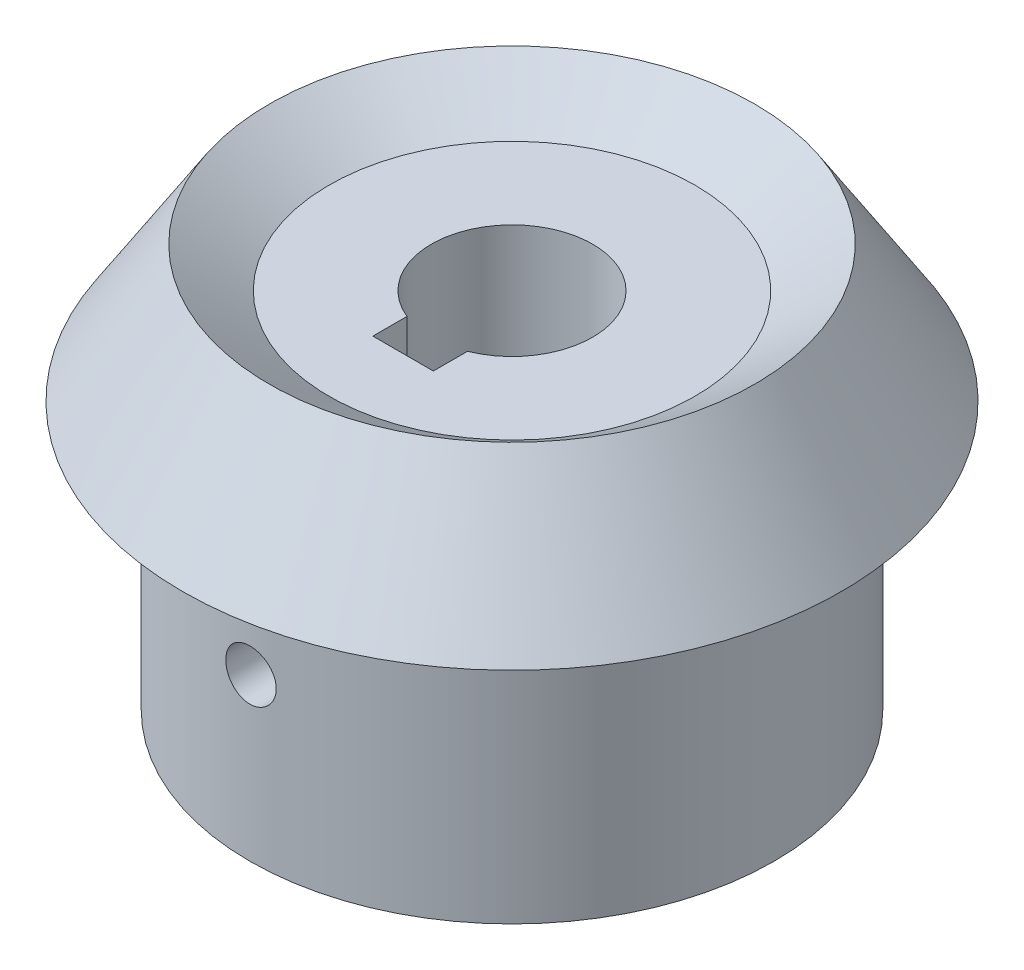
ISO-10303-21;
HEADER;
FILE_DESCRIPTION(('STEP AP214'),'2;1');
FILE_NAME('part.step','',(''),(''),'','','');
FILE_SCHEMA(('AUTOMOTIVE_DESIGN { 1 0 10303 214 1 1 1 1 }'));
ENDSEC;
DATA;
#1=APPLICATION_CONTEXT('core data for automotive mechanical design processes');
#2=APPLICATION_PROTOCOL_DEFINITION('international standard','automotive_design',2000,#1);
#3=PRODUCT_CONTEXT('',#1,'mechanical');
#4=PRODUCT('Part','Part','',(#3));
#5=PRODUCT_RELATED_PRODUCT_CATEGORY('part','',(#4));
#6=PRODUCT_DEFINITION_FORMATION('','',#4);
#7=PRODUCT_DEFINITION_CONTEXT('part definition',#1,'design');
#8=PRODUCT_DEFINITION('design','',#6,#7);
#9=PRODUCT_DEFINITION_SHAPE('','',#8);
#10=(LENGTH_UNIT() NAMED_UNIT(*) SI_UNIT(.MILLI.,.METRE.));
#11=(NAMED_UNIT(*) PLANE_ANGLE_UNIT() SI_UNIT($,.RADIAN.));
#12=(NAMED_UNIT(*) SI_UNIT($,.STERADIAN.) SOLID_ANGLE_UNIT());
#13=UNCERTAINTY_MEASURE_WITH_UNIT(LENGTH_MEASURE(1.E-05),#10,'distance_accuracy_value','');
#14=(GEOMETRIC_REPRESENTATION_CONTEXT(3) GLOBAL_UNCERTAINTY_ASSIGNED_CONTEXT((#13)) GLOBAL_UNIT_ASSIGNED_CONTEXT((#10,
#11,#12)) REPRESENTATION_CONTEXT('',''));
#15=CARTESIAN_POINT('',(0.,0.,0.));
#16=DIRECTION('',(0.,0.,1.));
#17=DIRECTION('',(1.,0.,0.));
#18=AXIS2_PLACEMENT_3D('',#15,#16,#17);
#19=CARTESIAN_POINT('',(0.,0.,0.));
#20=DIRECTION('',(0.,-1.,0.));
#21=DIRECTION('',(0.,0.,-1.));
#22=AXIS2_PLACEMENT_3D('',#19,#20,#21);
#23=CYLINDRICAL_SURFACE('',#22,4.);
#24=DIRECTION('',(0.,-1.,0.));
#25=VECTOR('',#24,1.);
#26=CARTESIAN_POINT('',(1.49999999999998,-6.93889390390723E-13,3.70809924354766));
#27=LINE('',#26,#25);
#28=CARTESIAN_POINT('',(1.49999999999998,18.,3.70809924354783));
#29=VERTEX_POINT('',#28);
#30=CARTESIAN_POINT('',(1.49999999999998,-6.93889390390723E-13,3.70809924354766));
#31=VERTEX_POINT('',#30);
#32=EDGE_CURVE('E71',#29,#31,#27,.T.);
#33=ORIENTED_EDGE('',*,*,#32,.F.);
#34=CARTESIAN_POINT('',(0.,18.,0.));
#35=DIRECTION('',(0.,-1.,0.));
#36=DIRECTION('',(0.,0.,-1.));
#37=AXIS2_PLACEMENT_3D('',#34,#35,#36);
#38=CIRCLE('',#37,4.);
#39=CARTESIAN_POINT('',(-1.50000000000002,18.,3.70809924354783));
#40=VERTEX_POINT('',#39);
#41=EDGE_CURVE('E95',#40,#29,#38,.T.);
#42=ORIENTED_EDGE('',*,*,#41,.F.);
#43=DIRECTION('',(0.,-1.,0.));
#44=VECTOR('',#43,1.);
#45=CARTESIAN_POINT('',(-1.50000000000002,-5.55111512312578E-13,3.70809924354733));
#46=LINE('',#45,#44);
#47=CARTESIAN_POINT('',(-1.50000000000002,-5.55111512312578E-13,3.70809924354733));
#48=VERTEX_POINT('',#47);
#49=EDGE_CURVE('E91',#48,#40,#46,.F.);
#50=ORIENTED_EDGE('',*,*,#49,.F.);
#51=CARTESIAN_POINT('',(0.,0.,0.));
#52=DIRECTION('',(0.,-1.,0.));
#53=DIRECTION('',(0.,0.,-1.));
#54=AXIS2_PLACEMENT_3D('',#51,#52,#53);
#55=CIRCLE('',#54,4.);
#56=EDGE_CURVE('E113',#48,#31,#55,.T.);
#57=ORIENTED_EDGE('',*,*,#56,.T.);
#58=EDGE_LOOP('',(#33,#42,#50,#57));
#59=FACE_BOUND('',#58,.T.);
#60=ADVANCED_FACE('F30',(#59),#23,.F.);
#61=CARTESIAN_POINT('',(4.,0.,0.));
#62=DIRECTION('',(0.,-1.,0.));
#63=DIRECTION('',(0.,0.,-1.));
#64=AXIS2_PLACEMENT_3D('',#61,#62,#63);
#65=PLANE('',#64);
#66=DIRECTION('',(0.,0.,1.));
#67=VECTOR('',#66,1.);
#68=CARTESIAN_POINT('',(1.49999999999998,-2.13717932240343E-12,-0.440807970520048));
#69=LINE('',#68,#67);
#70=CARTESIAN_POINT('',(1.49999999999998,0.,5.4));
#71=VERTEX_POINT('',#70);
#72=EDGE_CURVE('E67',#31,#71,#69,.T.);
#73=ORIENTED_EDGE('',*,*,#72,.F.);
#74=ORIENTED_EDGE('',*,*,#56,.F.);
#75=DIRECTION('',(0.,0.,-1.));
#76=VECTOR('',#75,1.);
#77=CARTESIAN_POINT('',(-1.50000000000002,-2.13717932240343E-12,-0.44080797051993));
#78=LINE('',#77,#76);
#79=CARTESIAN_POINT('',(-1.50000000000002,0.,5.4));
#80=VERTEX_POINT('',#79);
#81=EDGE_CURVE('E83',#80,#48,#78,.T.);
#82=ORIENTED_EDGE('',*,*,#81,.F.);
#83=DIRECTION('',(-1.,0.,0.));
#84=VECTOR('',#83,1.);
#85=CARTESIAN_POINT('',(1.49999999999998,0.,5.4));
#86=LINE('',#85,#84);
#87=EDGE_CURVE('E76',#71,#80,#86,.T.);
#88=ORIENTED_EDGE('',*,*,#87,.F.);
#89=EDGE_LOOP('',(#73,#74,#82,#88));
#90=FACE_BOUND('',#89,.T.);
#91=CARTESIAN_POINT('',(0.,0.,0.));
#92=DIRECTION('',(0.,-1.,0.));
#93=DIRECTION('',(0.,0.,-1.));
#94=AXIS2_PLACEMENT_3D('',#91,#92,#93);
#95=CIRCLE('',#94,13.);
#96=CARTESIAN_POINT('',(0.,0.,-13.));
#97=VERTEX_POINT('',#96);
#98=EDGE_CURVE('E110',#97,#97,#95,.T.);
#99=ORIENTED_EDGE('',*,*,#98,.T.);
#100=EDGE_LOOP('',(#99));
#101=FACE_BOUND('',#100,.T.);
#102=ADVANCED_FACE('F85',(#90,#101),#65,.T.);
#103=CARTESIAN_POINT('',(0.,0.,0.));
#104=DIRECTION('',(0.,-1.,0.));
#105=DIRECTION('',(0.,0.,-1.));
#106=AXIS2_PLACEMENT_3D('',#103,#104,#105);
#107=CYLINDRICAL_SURFACE('',#106,13.);
#108=CARTESIAN_POINT('',(-1.25000000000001,8.00000000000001,12.9397642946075));
#109=CARTESIAN_POINT('',(-1.24999695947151,7.92996129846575,12.9397650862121));
#110=CARTESIAN_POINT('',(-1.24409367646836,7.85987594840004,12.9403390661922));
#111=CARTESIAN_POINT('',(-1.22063294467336,7.72164740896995,12.942572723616));
#112=CARTESIAN_POINT('',(-1.20306256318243,7.65350646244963,12.9442336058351));
#113=CARTESIAN_POINT('',(-1.15678313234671,7.52118856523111,12.9484512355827));
#114=CARTESIAN_POINT('',(-1.12808072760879,7.45700927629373,12.9510074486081));
#115=CARTESIAN_POINT('',(-1.06036454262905,7.33439347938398,12.9567270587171));
#116=CARTESIAN_POINT('',(-1.02135284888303,7.27595581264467,12.9598903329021));
#117=CARTESIAN_POINT('',(-0.933983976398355,7.16627079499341,12.9664795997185));
#118=CARTESIAN_POINT('',(-0.885599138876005,7.11504551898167,12.9699063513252));
#119=CARTESIAN_POINT('',(-0.780916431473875,7.02142936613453,12.976629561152));
#120=CARTESIAN_POINT('',(-0.72461820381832,6.97903888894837,12.9799260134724));
#121=CARTESIAN_POINT('',(-0.605572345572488,6.90421995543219,12.9860246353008));
#122=CARTESIAN_POINT('',(-0.542812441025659,6.871810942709,12.9888258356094));
#123=CARTESIAN_POINT('',(-0.412710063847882,6.81799929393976,12.9936100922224));
#124=CARTESIAN_POINT('',(-0.345367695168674,6.79659640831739,12.9955931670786));
#125=CARTESIAN_POINT('',(-0.208234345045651,6.76546905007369,12.9985124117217));
#126=CARTESIAN_POINT('',(-0.138451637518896,6.75570843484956,12.9994518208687));
#127=CARTESIAN_POINT('',(0.0017673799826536,6.74803087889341,13.0001888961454));
#128=CARTESIAN_POINT('',(0.0722036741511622,6.75011365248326,12.9999865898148));
#129=CARTESIAN_POINT('',(0.211485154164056,6.76603435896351,12.9984656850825));
#130=CARTESIAN_POINT('',(0.280334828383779,6.77983342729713,12.9971507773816));
#131=CARTESIAN_POINT('',(0.414736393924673,6.81873450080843,12.9935567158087));
#132=CARTESIAN_POINT('',(0.480288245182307,6.84383664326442,12.9912775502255));
#133=CARTESIAN_POINT('',(0.60635618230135,6.90467409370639,12.9860049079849));
#134=CARTESIAN_POINT('',(0.666863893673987,6.94042665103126,12.9830102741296));
#135=CARTESIAN_POINT('',(0.781034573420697,7.02153752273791,12.9766428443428));
#136=CARTESIAN_POINT('',(0.834697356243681,7.06689609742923,12.9732700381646));
#137=CARTESIAN_POINT('',(0.933882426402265,7.16615013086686,12.966508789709));
#138=CARTESIAN_POINT('',(0.979370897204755,7.2200793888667,12.9631203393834));
#139=CARTESIAN_POINT('',(1.06065442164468,7.3348266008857,12.9567233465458));
#140=CARTESIAN_POINT('',(1.0964494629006,7.39564456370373,12.9537148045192));
#141=CARTESIAN_POINT('',(1.1573295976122,7.52246822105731,12.9484179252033));
#142=CARTESIAN_POINT('',(1.18241268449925,7.58847488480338,12.9461297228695));
#143=CARTESIAN_POINT('',(1.22113055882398,7.72378979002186,12.9425353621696));
#144=CARTESIAN_POINT('',(1.2347656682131,7.79309793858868,12.9412291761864));
#145=CARTESIAN_POINT('',(1.2501572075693,7.93275177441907,12.9397514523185));
#146=CARTESIAN_POINT('',(1.25196090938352,8.00309220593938,12.9395753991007));
#147=CARTESIAN_POINT('',(1.24376250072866,8.14307434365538,12.9403659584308));
#148=CARTESIAN_POINT('',(1.23376053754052,8.21271605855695,12.9413325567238));
#149=CARTESIAN_POINT('',(1.2022742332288,8.34918661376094,12.9442953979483));
#150=CARTESIAN_POINT('',(1.18081217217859,8.41602064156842,12.9462896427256));
#151=CARTESIAN_POINT('',(1.12703762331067,8.54513976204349,12.9510814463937));
#152=CARTESIAN_POINT('',(1.09472490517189,8.60742475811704,12.9538790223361));
#153=CARTESIAN_POINT('',(1.02004756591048,8.72589345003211,12.9599732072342));
#154=CARTESIAN_POINT('',(0.977651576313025,8.78205729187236,12.9632713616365));
#155=CARTESIAN_POINT('',(0.884056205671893,8.88648822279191,12.9699899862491));
#156=CARTESIAN_POINT('',(0.832856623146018,8.93475513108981,12.9734104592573));
#157=CARTESIAN_POINT('',(0.72290255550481,9.0221846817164,12.980001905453));
#158=CARTESIAN_POINT('',(0.664123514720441,9.06131651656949,12.9831720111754));
#159=CARTESIAN_POINT('',(0.540800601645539,9.12915326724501,12.9888929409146));
#160=CARTESIAN_POINT('',(0.47625680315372,9.15785831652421,12.9914437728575));
#161=CARTESIAN_POINT('',(0.343344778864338,9.20397428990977,12.9956348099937));
#162=CARTESIAN_POINT('',(0.27498309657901,9.22140393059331,12.997276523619));
#163=CARTESIAN_POINT('',(0.136286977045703,9.24453542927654,12.9994705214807));
#164=CARTESIAN_POINT('',(0.0659525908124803,9.25023759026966,13.0000228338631));
#165=CARTESIAN_POINT('',(-0.0743895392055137,9.24974818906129,12.9999757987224));
#166=CARTESIAN_POINT('',(-0.144397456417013,9.24360449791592,12.9993810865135));
#167=CARTESIAN_POINT('',(-0.282381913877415,9.2196980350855,12.9971159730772));
#168=CARTESIAN_POINT('',(-0.350358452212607,9.20193525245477,12.9954455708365));
#169=CARTESIAN_POINT('',(-0.482351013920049,9.15530782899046,12.9912162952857));
#170=CARTESIAN_POINT('',(-0.546367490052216,9.12644446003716,12.9886575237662));
#171=CARTESIAN_POINT('',(-0.668654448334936,9.05844036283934,12.9829369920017));
#172=CARTESIAN_POINT('',(-0.726924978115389,9.01929971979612,12.9797752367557));
#173=CARTESIAN_POINT('',(-0.83631125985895,8.93167248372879,12.9731878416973));
#174=CARTESIAN_POINT('',(-0.887398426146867,8.88315027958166,12.9697612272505));
#175=CARTESIAN_POINT('',(-0.980727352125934,8.77820641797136,12.9630385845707));
#176=CARTESIAN_POINT('',(-1.02296698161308,8.7217828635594,12.9597425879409));
#177=CARTESIAN_POINT('',(-1.09747961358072,8.60249289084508,12.9536459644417));
#178=CARTESIAN_POINT('',(-1.12972870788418,8.53961148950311,12.9508465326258));
#179=CARTESIAN_POINT('',(-1.18316795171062,8.40934006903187,12.9460743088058));
#180=CARTESIAN_POINT('',(-1.20437063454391,8.34195525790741,12.9441005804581));
#181=CARTESIAN_POINT('',(-1.22979995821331,8.22848738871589,12.9417034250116));
#182=CARTESIAN_POINT('',(-1.23736469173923,8.18313087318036,12.9409796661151));
#183=CARTESIAN_POINT('',(-1.24746570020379,8.09185625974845,12.9400098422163));
#184=CARTESIAN_POINT('',(-1.2500019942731,8.04593816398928,12.9397637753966));
#185=CARTESIAN_POINT('',(-1.25000000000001,8.00000000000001,12.9397642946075));
#186=B_SPLINE_CURVE_WITH_KNOTS('',3,(#108,#109,#110,#111,#112,#113,#114,#115,#116,#117,#118,
#119,#120,#121,#122,#123,#124,#125,#126,#127,#128,#129,#130,#131,#132,#133,#134,#135,#136,#137,
#138,#139,#140,#141,#142,#143,#144,#145,#146,#147,#148,#149,#150,#151,#152,#153,#154,#155,#156,
#157,#158,#159,#160,#161,#162,#163,#164,#165,#166,#167,#168,#169,#170,#171,#172,#173,#174,#175,
#176,#177,#178,#179,#180,#181,#182,#183,#184,#185),.UNSPECIFIED.,.T.,.F.,(4,2,2,2,2,2,2,2,2,2,2,
2,2,2,2,2,2,2,2,2,2,2,2,2,2,2,2,2,2,2,2,2,2,2,2,2,2,2,4),(0.,0.209948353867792,
0.420129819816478,0.630186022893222,0.840199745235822,1.05084289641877,1.26149557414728,
1.47255603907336,1.68361171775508,1.8940104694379,2.10440414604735,2.31410263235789,
2.52380366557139,2.73384619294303,2.94389441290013,3.15479252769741,3.36569091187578,
3.57662878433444,3.78756072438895,3.99764937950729,4.20773541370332,4.41741448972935,
4.62709801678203,4.83744259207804,5.0477919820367,5.25884083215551,5.46988698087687,
5.6805818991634,5.89127137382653,6.10111120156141,6.31095122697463,6.52076721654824,
6.73058146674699,6.94120835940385,7.15188590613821,7.36306379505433,7.57400155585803,
7.71170654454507,7.84941100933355),.UNSPECIFIED.);
#187=CARTESIAN_POINT('',(-1.25000000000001,8.00000000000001,12.9397642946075));
#188=VERTEX_POINT('',#187);
#189=EDGE_CURVE('E161',#188,#188,#186,.T.);
#190=ORIENTED_EDGE('',*,*,#189,.F.);
#191=EDGE_LOOP('',(#190));
#192=FACE_BOUND('',#191,.T.);
#193=CARTESIAN_POINT('',(0.,10.9999999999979,-1.11022302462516E-13));
#194=DIRECTION('',(0.,-1.,0.));
#195=DIRECTION('',(0.,0.,-1.));
#196=AXIS2_PLACEMENT_3D('',#193,#194,#195);
#197=CIRCLE('',#196,13.);
#198=CARTESIAN_POINT('',(0.,10.9999999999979,-13.0000000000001));
#199=VERTEX_POINT('',#198);
#200=EDGE_CURVE('E107',#199,#199,#197,.T.);
#201=ORIENTED_EDGE('',*,*,#200,.T.);
#202=EDGE_LOOP('',(#201));
#203=FACE_BOUND('',#202,.T.);
#204=ORIENTED_EDGE('',*,*,#98,.F.);
#205=EDGE_LOOP('',(#204));
#206=FACE_BOUND('',#205,.T.);
#207=ADVANCED_FACE('F128',(#192,#203,#206),#107,.T.);
#208=CARTESIAN_POINT('',(0.,10.9999999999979,-1.11022302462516E-13));
#209=DIRECTION('',(0.,1.,0.));
#210=DIRECTION('',(0.,0.,1.));
#211=AXIS2_PLACEMENT_3D('',#208,#209,#210);
#212=CONICAL_SURFACE('',#211,13.,0.977046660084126);
#213=CARTESIAN_POINT('',(0.,13.2545,0.));
#214=DIRECTION('',(0.,-1.,0.));
#215=DIRECTION('',(0.,0.,-1.));
#216=AXIS2_PLACEMENT_3D('',#213,#214,#215);
#217=CIRCLE('',#216,16.34);
#218=CARTESIAN_POINT('',(0.,13.2545,-16.34));
#219=VERTEX_POINT('',#218);
#220=EDGE_CURVE('E104',#219,#219,#217,.T.);
#221=ORIENTED_EDGE('',*,*,#220,.T.);
#222=EDGE_LOOP('',(#221));
#223=FACE_BOUND('',#222,.T.);
#224=ORIENTED_EDGE('',*,*,#200,.F.);
#225=EDGE_LOOP('',(#224));
#226=FACE_BOUND('',#225,.T.);
#227=ADVANCED_FACE('F132',(#223,#226),#212,.T.);
#228=CARTESIAN_POINT('',(0.,13.2545,0.));
#229=DIRECTION('',(0.,-1.,0.));
#230=DIRECTION('',(0.,0.,-1.));
#231=AXIS2_PLACEMENT_3D('',#228,#229,#230);
#232=CONICAL_SURFACE('',#231,16.34,0.568126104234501);
#233=CARTESIAN_POINT('',(0.,20.,0.));
#234=DIRECTION('',(0.,-1.,0.));
#235=DIRECTION('',(0.,0.,-1.));
#236=AXIS2_PLACEMENT_3D('',#233,#234,#235);
#237=CIRCLE('',#236,12.0341588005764);
#238=CARTESIAN_POINT('',(0.,20.,-12.0341588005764));
#239=VERTEX_POINT('',#238);
#240=EDGE_CURVE('E101',#239,#239,#237,.T.);
#241=ORIENTED_EDGE('',*,*,#240,.T.);
#242=EDGE_LOOP('',(#241));
#243=FACE_BOUND('',#242,.T.);
#244=ORIENTED_EDGE('',*,*,#220,.F.);
#245=EDGE_LOOP('',(#244));
#246=FACE_BOUND('',#245,.T.);
#247=ADVANCED_FACE('F138',(#243,#246),#232,.T.);
#248=CARTESIAN_POINT('',(0.,20.,0.));
#249=DIRECTION('',(0.,1.,0.));
#250=DIRECTION('',(0.,0.,1.));
#251=AXIS2_PLACEMENT_3D('',#248,#249,#250);
#252=CONICAL_SURFACE('',#251,12.0341588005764,0.977046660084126);
#253=CARTESIAN_POINT('',(0.,18.,0.));
#254=DIRECTION('',(0.,-1.,0.));
#255=DIRECTION('',(0.,0.,-1.));
#256=AXIS2_PLACEMENT_3D('',#253,#254,#255);
#257=CIRCLE('',#256,9.07119583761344);
#258=CARTESIAN_POINT('',(0.,18.,-9.07119583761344));
#259=VERTEX_POINT('',#258);
#260=EDGE_CURVE('E98',#259,#259,#257,.T.);
#261=ORIENTED_EDGE('',*,*,#260,.T.);
#262=EDGE_LOOP('',(#261));
#263=FACE_BOUND('',#262,.T.);
#264=ORIENTED_EDGE('',*,*,#240,.F.);
#265=EDGE_LOOP('',(#264));
#266=FACE_BOUND('',#265,.T.);
#267=ADVANCED_FACE('F142',(#263,#266),#252,.F.);
#268=CARTESIAN_POINT('',(9.07119583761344,18.,5.34294830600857E-13));
#269=DIRECTION('',(0.,1.,0.));
#270=DIRECTION('',(0.,0.,1.));
#271=AXIS2_PLACEMENT_3D('',#268,#269,#270);
#272=PLANE('',#271);
#273=DIRECTION('',(0.,0.,-1.));
#274=VECTOR('',#273,1.);
#275=CARTESIAN_POINT('',(1.49999999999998,18.,0.));
#276=LINE('',#275,#274);
#277=CARTESIAN_POINT('',(1.49999999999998,17.9999999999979,5.39999999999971));
#278=VERTEX_POINT('',#277);
#279=EDGE_CURVE('E11',#278,#29,#276,.T.);
#280=ORIENTED_EDGE('',*,*,#279,.F.);
#281=DIRECTION('',(1.,0.,0.));
#282=VECTOR('',#281,1.);
#283=CARTESIAN_POINT('',(9.07119583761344,17.9999999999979,5.39999999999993));
#284=LINE('',#283,#282);
#285=CARTESIAN_POINT('',(-1.50000000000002,17.9999999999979,5.39999999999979));
#286=VERTEX_POINT('',#285);
#287=EDGE_CURVE('E82',#286,#278,#284,.T.);
#288=ORIENTED_EDGE('',*,*,#287,.F.);
#289=DIRECTION('',(0.,0.,1.));
#290=VECTOR('',#289,1.);
#291=CARTESIAN_POINT('',(-1.50000000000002,18.,0.));
#292=LINE('',#291,#290);
#293=EDGE_CURVE('E37',#40,#286,#292,.T.);
#294=ORIENTED_EDGE('',*,*,#293,.F.);
#295=ORIENTED_EDGE('',*,*,#41,.T.);
#296=EDGE_LOOP('',(#280,#288,#294,#295));
#297=FACE_BOUND('',#296,.T.);
#298=ORIENTED_EDGE('',*,*,#260,.F.);
#299=EDGE_LOOP('',(#298));
#300=FACE_BOUND('',#299,.T.);
#301=ADVANCED_FACE('F121',(#297,#300),#272,.T.);
#302=CARTESIAN_POINT('',(1.49999999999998,19.9999999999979,-0.440807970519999));
#303=DIRECTION('',(1.,0.,0.));
#304=DIRECTION('',(0.,0.,-1.));
#305=AXIS2_PLACEMENT_3D('',#302,#303,#304);
#306=PLANE('',#305);
#307=ORIENTED_EDGE('',*,*,#32,.T.);
#308=ORIENTED_EDGE('',*,*,#72,.T.);
#309=DIRECTION('',(0.,-1.,0.));
#310=VECTOR('',#309,1.);
#311=CARTESIAN_POINT('',(1.49999999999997,20.,5.4));
#312=LINE('',#311,#310);
#313=EDGE_CURVE('E70',#278,#71,#312,.T.);
#314=ORIENTED_EDGE('',*,*,#313,.F.);
#315=ORIENTED_EDGE('',*,*,#279,.T.);
#316=EDGE_LOOP('',(#307,#308,#314,#315));
#317=FACE_BOUND('',#316,.T.);
#318=ADVANCED_FACE('F69',(#317),#306,.F.);
#319=CARTESIAN_POINT('',(-1.50000000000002,19.9999999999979,-0.44080797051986));
#320=DIRECTION('',(-1.,0.,0.));
#321=DIRECTION('',(0.,0.,1.));
#322=AXIS2_PLACEMENT_3D('',#319,#320,#321);
#323=PLANE('',#322);
#324=ORIENTED_EDGE('',*,*,#49,.T.);
#325=ORIENTED_EDGE('',*,*,#293,.T.);
#326=DIRECTION('',(0.,-1.,0.));
#327=VECTOR('',#326,1.);
#328=CARTESIAN_POINT('',(-1.50000000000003,20.,5.4));
#329=LINE('',#328,#327);
#330=EDGE_CURVE('E44',#286,#80,#329,.T.);
#331=ORIENTED_EDGE('',*,*,#330,.T.);
#332=ORIENTED_EDGE('',*,*,#81,.T.);
#333=EDGE_LOOP('',(#324,#325,#331,#332));
#334=FACE_BOUND('',#333,.T.);
#335=ADVANCED_FACE('F117',(#334),#323,.F.);
#336=CARTESIAN_POINT('',(1.49999999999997,20.,5.4));
#337=DIRECTION('',(0.,0.,1.));
#338=DIRECTION('',(1.,0.,0.));
#339=AXIS2_PLACEMENT_3D('',#336,#337,#338);
#340=PLANE('',#339);
#341=CARTESIAN_POINT('',(0.,7.99999999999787,5.39999999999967));
#342=DIRECTION('',(0.,0.,1.));
#343=DIRECTION('',(1.,0.,0.));
#344=AXIS2_PLACEMENT_3D('',#341,#342,#343);
#345=CIRCLE('',#344,1.25);
#346=CARTESIAN_POINT('',(1.25,7.99999999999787,5.39999999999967));
#347=VERTEX_POINT('',#346);
#348=EDGE_CURVE('E77',#347,#347,#345,.T.);
#349=ORIENTED_EDGE('',*,*,#348,.T.);
#350=EDGE_LOOP('',(#349));
#351=FACE_BOUND('',#350,.T.);
#352=ORIENTED_EDGE('',*,*,#287,.T.);
#353=ORIENTED_EDGE('',*,*,#313,.T.);
#354=ORIENTED_EDGE('',*,*,#87,.T.);
#355=ORIENTED_EDGE('',*,*,#330,.F.);
#356=EDGE_LOOP('',(#352,#353,#354,#355));
#357=FACE_BOUND('',#356,.T.);
#358=ADVANCED_FACE('F79',(#351,#357),#340,.F.);
#359=CARTESIAN_POINT('',(0.,7.99999999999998,-5.34294830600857E-13));
#360=DIRECTION('',(0.,0.,-1.));
#361=DIRECTION('',(-1.,0.,0.));
#362=AXIS2_PLACEMENT_3D('',#359,#360,#361);
#363=CYLINDRICAL_SURFACE('',#362,1.25);
#364=ORIENTED_EDGE('',*,*,#189,.T.);
#365=EDGE_LOOP('',(#364));
#366=FACE_BOUND('',#365,.T.);
#367=ORIENTED_EDGE('',*,*,#348,.F.);
#368=EDGE_LOOP('',(#367));
#369=FACE_BOUND('',#368,.T.);
#370=ADVANCED_FACE('F153',(#366,#369),#363,.F.);
#371=CLOSED_SHELL('',(#60,#102,#207,#227,#247,#267,#301,#318,#335,#358,#370));
#372=MANIFOLD_SOLID_BREP('B2',#371);
#373=ADVANCED_BREP_SHAPE_REPRESENTATION('',(#18,#372),#14);
#374=SHAPE_DEFINITION_REPRESENTATION(#9,#373);
ENDSEC;
END-ISO-10303-21;
